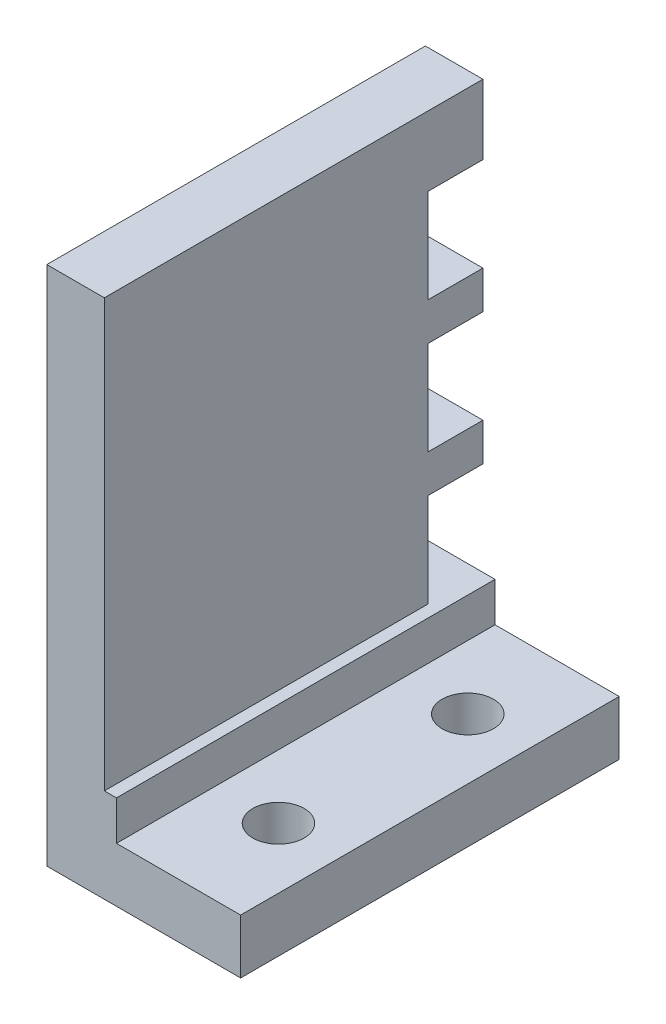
ISO-10303-21;
HEADER;
FILE_DESCRIPTION(('STEP AP214'),'2;1');
FILE_NAME('part.step','',(''),(''),'','','');
FILE_SCHEMA(('AUTOMOTIVE_DESIGN { 1 0 10303 214 1 1 1 1 }'));
ENDSEC;
DATA;
#1=APPLICATION_CONTEXT('core data for automotive mechanical design processes');
#2=APPLICATION_PROTOCOL_DEFINITION('international standard','automotive_design',2000,#1);
#3=PRODUCT_CONTEXT('',#1,'mechanical');
#4=PRODUCT('Part','Part','',(#3));
#5=PRODUCT_RELATED_PRODUCT_CATEGORY('part','',(#4));
#6=PRODUCT_DEFINITION_FORMATION('','',#4);
#7=PRODUCT_DEFINITION_CONTEXT('part definition',#1,'design');
#8=PRODUCT_DEFINITION('design','',#6,#7);
#9=PRODUCT_DEFINITION_SHAPE('','',#8);
#10=(LENGTH_UNIT() NAMED_UNIT(*) SI_UNIT(.MILLI.,.METRE.));
#11=(NAMED_UNIT(*) PLANE_ANGLE_UNIT() SI_UNIT($,.RADIAN.));
#12=(NAMED_UNIT(*) SI_UNIT($,.STERADIAN.) SOLID_ANGLE_UNIT());
#13=UNCERTAINTY_MEASURE_WITH_UNIT(LENGTH_MEASURE(1.E-05),#10,'distance_accuracy_value','');
#14=(GEOMETRIC_REPRESENTATION_CONTEXT(3) GLOBAL_UNCERTAINTY_ASSIGNED_CONTEXT((#13)) GLOBAL_UNIT_ASSIGNED_CONTEXT((#10,
#11,#12)) REPRESENTATION_CONTEXT('',''));
#15=CARTESIAN_POINT('',(0.,0.,0.));
#16=DIRECTION('',(0.,0.,1.));
#17=DIRECTION('',(1.,0.,0.));
#18=AXIS2_PLACEMENT_3D('',#15,#16,#17);
#19=CARTESIAN_POINT('',(0.,0.,0.));
#20=DIRECTION('',(0.,0.,1.));
#21=DIRECTION('',(1.,0.,0.));
#22=AXIS2_PLACEMENT_3D('',#19,#20,#21);
#23=PLANE('',#22);
#24=DIRECTION('',(0.,1.,0.));
#25=VECTOR('',#24,1.);
#26=CARTESIAN_POINT('',(4.826,7.874,0.));
#27=LINE('',#26,#25);
#28=CARTESIAN_POINT('',(4.826,15.748,0.));
#29=VERTEX_POINT('',#28);
#30=CARTESIAN_POINT('',(4.826,18.923,0.));
#31=VERTEX_POINT('',#30);
#32=EDGE_CURVE('E53',#29,#31,#27,.T.);
#33=ORIENTED_EDGE('',*,*,#32,.F.);
#34=DIRECTION('',(1.,0.,0.));
#35=VECTOR('',#34,1.);
#36=CARTESIAN_POINT('',(-0.00100000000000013,15.748,0.));
#37=LINE('',#36,#35);
#38=CARTESIAN_POINT('',(0.,15.748,0.));
#39=VERTEX_POINT('',#38);
#40=EDGE_CURVE('E183',#39,#29,#37,.T.);
#41=ORIENTED_EDGE('',*,*,#40,.F.);
#42=DIRECTION('',(0.,-1.,0.));
#43=VECTOR('',#42,1.);
#44=CARTESIAN_POINT('',(0.,43.688,0.));
#45=LINE('',#44,#43);
#46=CARTESIAN_POINT('',(0.,18.923,0.));
#47=VERTEX_POINT('',#46);
#48=EDGE_CURVE('E368',#47,#39,#45,.T.);
#49=ORIENTED_EDGE('',*,*,#48,.F.);
#50=DIRECTION('',(1.,0.,0.));
#51=VECTOR('',#50,1.);
#52=CARTESIAN_POINT('',(-0.00100000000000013,18.923,0.));
#53=LINE('',#52,#51);
#54=EDGE_CURVE('E226',#47,#31,#53,.T.);
#55=ORIENTED_EDGE('',*,*,#54,.T.);
#56=EDGE_LOOP('',(#33,#41,#49,#55));
#57=FACE_BOUND('',#56,.T.);
#58=ADVANCED_FACE('F37',(#57),#23,.F.);
#59=CARTESIAN_POINT('',(4.826,26.797,0.));
#60=VERTEX_POINT('',#59);
#61=CARTESIAN_POINT('',(4.826,29.972,0.));
#62=VERTEX_POINT('',#61);
#63=EDGE_CURVE('E60',#60,#62,#27,.T.);
#64=ORIENTED_EDGE('',*,*,#63,.F.);
#65=DIRECTION('',(1.,0.,0.));
#66=VECTOR('',#65,1.);
#67=CARTESIAN_POINT('',(-0.00100000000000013,26.797,0.));
#68=LINE('',#67,#66);
#69=CARTESIAN_POINT('',(0.,26.797,0.));
#70=VERTEX_POINT('',#69);
#71=EDGE_CURVE('E224',#70,#60,#68,.T.);
#72=ORIENTED_EDGE('',*,*,#71,.F.);
#73=CARTESIAN_POINT('',(0.,29.972,0.));
#74=VERTEX_POINT('',#73);
#75=EDGE_CURVE('E292',#74,#70,#45,.T.);
#76=ORIENTED_EDGE('',*,*,#75,.F.);
#77=DIRECTION('',(1.,0.,0.));
#78=VECTOR('',#77,1.);
#79=CARTESIAN_POINT('',(-0.00100000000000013,29.972,0.));
#80=LINE('',#79,#78);
#81=EDGE_CURVE('E251',#74,#62,#80,.T.);
#82=ORIENTED_EDGE('',*,*,#81,.T.);
#83=EDGE_LOOP('',(#64,#72,#76,#82));
#84=FACE_BOUND('',#83,.T.);
#85=ADVANCED_FACE('F367',(#84),#23,.F.);
#86=CARTESIAN_POINT('',(4.826,37.846,0.));
#87=VERTEX_POINT('',#86);
#88=CARTESIAN_POINT('',(4.826,43.688,0.));
#89=VERTEX_POINT('',#88);
#90=EDGE_CURVE('E301',#87,#89,#27,.T.);
#91=ORIENTED_EDGE('',*,*,#90,.F.);
#92=DIRECTION('',(1.,0.,0.));
#93=VECTOR('',#92,1.);
#94=CARTESIAN_POINT('',(-0.00100000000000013,37.846,0.));
#95=LINE('',#94,#93);
#96=CARTESIAN_POINT('',(0.,37.846,0.));
#97=VERTEX_POINT('',#96);
#98=EDGE_CURVE('E249',#97,#87,#95,.T.);
#99=ORIENTED_EDGE('',*,*,#98,.F.);
#100=CARTESIAN_POINT('',(0.,43.688,0.));
#101=VERTEX_POINT('',#100);
#102=EDGE_CURVE('E288',#101,#97,#45,.T.);
#103=ORIENTED_EDGE('',*,*,#102,.F.);
#104=DIRECTION('',(-1.,0.,0.));
#105=VECTOR('',#104,1.);
#106=CARTESIAN_POINT('',(4.826,43.688,0.));
#107=LINE('',#106,#105);
#108=EDGE_CURVE('E266',#89,#101,#107,.T.);
#109=ORIENTED_EDGE('',*,*,#108,.F.);
#110=EDGE_LOOP('',(#91,#99,#103,#109));
#111=FACE_BOUND('',#110,.T.);
#112=ADVANCED_FACE('F350',(#111),#23,.F.);
#113=CARTESIAN_POINT('',(4.826,43.688,31.75));
#114=DIRECTION('',(0.,-1.,0.));
#115=DIRECTION('',(0.,0.,-1.));
#116=AXIS2_PLACEMENT_3D('',#113,#114,#115);
#117=PLANE('',#116);
#118=ORIENTED_EDGE('',*,*,#108,.T.);
#119=DIRECTION('',(0.,0.,-1.));
#120=VECTOR('',#119,1.);
#121=CARTESIAN_POINT('',(0.,43.688,31.75));
#122=LINE('',#121,#120);
#123=CARTESIAN_POINT('',(0.,43.688,31.75));
#124=VERTEX_POINT('',#123);
#125=EDGE_CURVE('E11',#124,#101,#122,.T.);
#126=ORIENTED_EDGE('',*,*,#125,.F.);
#127=DIRECTION('',(-1.,0.,0.));
#128=VECTOR('',#127,1.);
#129=CARTESIAN_POINT('',(4.826,43.688,31.75));
#130=LINE('',#129,#128);
#131=CARTESIAN_POINT('',(4.826,43.688,31.75));
#132=VERTEX_POINT('',#131);
#133=EDGE_CURVE('E267',#132,#124,#130,.T.);
#134=ORIENTED_EDGE('',*,*,#133,.F.);
#135=DIRECTION('',(0.,0.,-1.));
#136=VECTOR('',#135,1.);
#137=CARTESIAN_POINT('',(4.826,43.688,31.75));
#138=LINE('',#137,#136);
#139=EDGE_CURVE('E284',#132,#89,#138,.T.);
#140=ORIENTED_EDGE('',*,*,#139,.T.);
#141=EDGE_LOOP('',(#118,#126,#134,#140));
#142=FACE_BOUND('',#141,.T.);
#143=ADVANCED_FACE('F39',(#142),#117,.F.);
#144=CARTESIAN_POINT('',(0.,43.688,31.75));
#145=DIRECTION('',(1.,0.,0.));
#146=DIRECTION('',(0.,1.,0.));
#147=AXIS2_PLACEMENT_3D('',#144,#145,#146);
#148=PLANE('',#147);
#149=ORIENTED_EDGE('',*,*,#48,.T.);
#150=DIRECTION('',(0.,0.,-1.));
#151=VECTOR('',#150,1.);
#152=CARTESIAN_POINT('',(0.,15.748,4.6228));
#153=LINE('',#152,#151);
#154=CARTESIAN_POINT('',(0.,15.748,4.6228));
#155=VERTEX_POINT('',#154);
#156=EDGE_CURVE('E199',#155,#39,#153,.T.);
#157=ORIENTED_EDGE('',*,*,#156,.F.);
#158=DIRECTION('',(0.,1.,0.));
#159=VECTOR('',#158,1.);
#160=CARTESIAN_POINT('',(0.,15.748,4.6228));
#161=LINE('',#160,#159);
#162=CARTESIAN_POINT('',(0.,7.874,4.6228));
#163=VERTEX_POINT('',#162);
#164=EDGE_CURVE('E176',#163,#155,#161,.T.);
#165=ORIENTED_EDGE('',*,*,#164,.F.);
#166=DIRECTION('',(0.,0.,1.));
#167=VECTOR('',#166,1.);
#168=CARTESIAN_POINT('',(0.,7.874,4.6228));
#169=LINE('',#168,#167);
#170=CARTESIAN_POINT('',(0.,7.874,0.));
#171=VERTEX_POINT('',#170);
#172=EDGE_CURVE('E187',#171,#163,#169,.T.);
#173=ORIENTED_EDGE('',*,*,#172,.F.);
#174=CARTESIAN_POINT('',(0.,0.,0.));
#175=VERTEX_POINT('',#174);
#176=EDGE_CURVE('E287',#171,#175,#45,.T.);
#177=ORIENTED_EDGE('',*,*,#176,.T.);
#178=DIRECTION('',(0.,0.,-1.));
#179=VECTOR('',#178,1.);
#180=CARTESIAN_POINT('',(0.,0.,31.75));
#181=LINE('',#180,#179);
#182=CARTESIAN_POINT('',(0.,0.,31.75));
#183=VERTEX_POINT('',#182);
#184=EDGE_CURVE('E46',#183,#175,#181,.T.);
#185=ORIENTED_EDGE('',*,*,#184,.F.);
#186=DIRECTION('',(0.,-1.,0.));
#187=VECTOR('',#186,1.);
#188=CARTESIAN_POINT('',(0.,43.688,31.75));
#189=LINE('',#188,#187);
#190=EDGE_CURVE('E270',#124,#183,#189,.T.);
#191=ORIENTED_EDGE('',*,*,#190,.F.);
#192=ORIENTED_EDGE('',*,*,#125,.T.);
#193=ORIENTED_EDGE('',*,*,#102,.T.);
#194=DIRECTION('',(0.,0.,-1.));
#195=VECTOR('',#194,1.);
#196=CARTESIAN_POINT('',(0.,37.846,4.6228));
#197=LINE('',#196,#195);
#198=CARTESIAN_POINT('',(0.,37.846,4.6228));
#199=VERTEX_POINT('',#198);
#200=EDGE_CURVE('E235',#199,#97,#197,.T.);
#201=ORIENTED_EDGE('',*,*,#200,.F.);
#202=DIRECTION('',(0.,1.,0.));
#203=VECTOR('',#202,1.);
#204=CARTESIAN_POINT('',(0.,37.846,4.6228));
#205=LINE('',#204,#203);
#206=CARTESIAN_POINT('',(0.,29.972,4.6228));
#207=VERTEX_POINT('',#206);
#208=EDGE_CURVE('E232',#207,#199,#205,.T.);
#209=ORIENTED_EDGE('',*,*,#208,.F.);
#210=DIRECTION('',(0.,0.,1.));
#211=VECTOR('',#210,1.);
#212=CARTESIAN_POINT('',(0.,29.972,4.6228));
#213=LINE('',#212,#211);
#214=EDGE_CURVE('E248',#74,#207,#213,.T.);
#215=ORIENTED_EDGE('',*,*,#214,.F.);
#216=ORIENTED_EDGE('',*,*,#75,.T.);
#217=DIRECTION('',(0.,0.,-1.));
#218=VECTOR('',#217,1.);
#219=CARTESIAN_POINT('',(0.,26.797,4.6228));
#220=LINE('',#219,#218);
#221=CARTESIAN_POINT('',(0.,26.797,4.6228));
#222=VERTEX_POINT('',#221);
#223=EDGE_CURVE('E210',#222,#70,#220,.T.);
#224=ORIENTED_EDGE('',*,*,#223,.F.);
#225=DIRECTION('',(0.,1.,0.));
#226=VECTOR('',#225,1.);
#227=CARTESIAN_POINT('',(0.,26.797,4.6228));
#228=LINE('',#227,#226);
#229=CARTESIAN_POINT('',(0.,18.923,4.6228));
#230=VERTEX_POINT('',#229);
#231=EDGE_CURVE('E194',#230,#222,#228,.T.);
#232=ORIENTED_EDGE('',*,*,#231,.F.);
#233=DIRECTION('',(0.,0.,1.));
#234=VECTOR('',#233,1.);
#235=CARTESIAN_POINT('',(0.,18.923,4.6228));
#236=LINE('',#235,#234);
#237=EDGE_CURVE('E223',#47,#230,#236,.T.);
#238=ORIENTED_EDGE('',*,*,#237,.F.);
#239=EDGE_LOOP('',(#149,#157,#165,#173,#177,#185,#191,#192,#193,#201,#209,#215,#216,#224,#232,#238));
#240=FACE_BOUND('',#239,.T.);
#241=ADVANCED_FACE('F198',(#240),#148,.F.);
#242=CARTESIAN_POINT('',(0.,0.,31.75));
#243=DIRECTION('',(0.,1.,0.));
#244=DIRECTION('',(0.,0.,1.));
#245=AXIS2_PLACEMENT_3D('',#242,#243,#244);
#246=PLANE('',#245);
#247=CARTESIAN_POINT('',(11.176,0.,23.495));
#248=DIRECTION('',(0.,-1.,0.));
#249=DIRECTION('',(0.,0.,-1.));
#250=AXIS2_PLACEMENT_3D('',#247,#248,#249);
#251=CIRCLE('',#250,2.15265);
#252=CARTESIAN_POINT('',(11.176,0.,21.34235));
#253=VERTEX_POINT('',#252);
#254=EDGE_CURVE('E257',#253,#253,#251,.T.);
#255=ORIENTED_EDGE('',*,*,#254,.F.);
#256=EDGE_LOOP('',(#255));
#257=FACE_BOUND('',#256,.T.);
#258=CARTESIAN_POINT('',(11.176,0.,7.62));
#259=DIRECTION('',(0.,-1.,0.));
#260=DIRECTION('',(0.,0.,-1.));
#261=AXIS2_PLACEMENT_3D('',#258,#259,#260);
#262=CIRCLE('',#261,2.15265);
#263=CARTESIAN_POINT('',(11.176,0.,5.46735000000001));
#264=VERTEX_POINT('',#263);
#265=EDGE_CURVE('E260',#264,#264,#262,.T.);
#266=ORIENTED_EDGE('',*,*,#265,.F.);
#267=EDGE_LOOP('',(#266));
#268=FACE_BOUND('',#267,.T.);
#269=DIRECTION('',(1.,0.,0.));
#270=VECTOR('',#269,1.);
#271=CARTESIAN_POINT('',(0.,0.,0.));
#272=LINE('',#271,#270);
#273=CARTESIAN_POINT('',(16.256,0.,0.));
#274=VERTEX_POINT('',#273);
#275=EDGE_CURVE('E291',#175,#274,#272,.T.);
#276=ORIENTED_EDGE('',*,*,#275,.T.);
#277=DIRECTION('',(0.,0.,-1.));
#278=VECTOR('',#277,1.);
#279=CARTESIAN_POINT('',(16.256,0.,31.75));
#280=LINE('',#279,#278);
#281=CARTESIAN_POINT('',(16.256,0.,31.75));
#282=VERTEX_POINT('',#281);
#283=EDGE_CURVE('E315',#282,#274,#280,.T.);
#284=ORIENTED_EDGE('',*,*,#283,.F.);
#285=DIRECTION('',(1.,0.,0.));
#286=VECTOR('',#285,1.);
#287=CARTESIAN_POINT('',(0.,0.,31.75));
#288=LINE('',#287,#286);
#289=EDGE_CURVE('E272',#183,#282,#288,.T.);
#290=ORIENTED_EDGE('',*,*,#289,.F.);
#291=ORIENTED_EDGE('',*,*,#184,.T.);
#292=EDGE_LOOP('',(#276,#284,#290,#291));
#293=FACE_BOUND('',#292,.T.);
#294=ADVANCED_FACE('F323',(#257,#268,#293),#246,.F.);
#295=CARTESIAN_POINT('',(16.256,0.,31.75));
#296=DIRECTION('',(-1.,0.,0.));
#297=DIRECTION('',(0.,0.,1.));
#298=AXIS2_PLACEMENT_3D('',#295,#296,#297);
#299=PLANE('',#298);
#300=DIRECTION('',(0.,1.,0.));
#301=VECTOR('',#300,1.);
#302=CARTESIAN_POINT('',(16.256,0.,0.));
#303=LINE('',#302,#301);
#304=CARTESIAN_POINT('',(16.256,4.572,0.));
#305=VERTEX_POINT('',#304);
#306=EDGE_CURVE('E294',#274,#305,#303,.T.);
#307=ORIENTED_EDGE('',*,*,#306,.T.);
#308=DIRECTION('',(0.,0.,-1.));
#309=VECTOR('',#308,1.);
#310=CARTESIAN_POINT('',(16.256,4.572,31.75));
#311=LINE('',#310,#309);
#312=CARTESIAN_POINT('',(16.256,4.572,31.75));
#313=VERTEX_POINT('',#312);
#314=EDGE_CURVE('E312',#313,#305,#311,.T.);
#315=ORIENTED_EDGE('',*,*,#314,.F.);
#316=DIRECTION('',(0.,1.,0.));
#317=VECTOR('',#316,1.);
#318=CARTESIAN_POINT('',(16.256,0.,31.75));
#319=LINE('',#318,#317);
#320=EDGE_CURVE('E274',#282,#313,#319,.T.);
#321=ORIENTED_EDGE('',*,*,#320,.F.);
#322=ORIENTED_EDGE('',*,*,#283,.T.);
#323=EDGE_LOOP('',(#307,#315,#321,#322));
#324=FACE_BOUND('',#323,.T.);
#325=ADVANCED_FACE('F332',(#324),#299,.F.);
#326=CARTESIAN_POINT('',(16.256,4.572,31.75));
#327=DIRECTION('',(0.,-1.,0.));
#328=DIRECTION('',(1.,0.,0.));
#329=AXIS2_PLACEMENT_3D('',#326,#327,#328);
#330=PLANE('',#329);
#331=CARTESIAN_POINT('',(11.176,4.572,23.495));
#332=DIRECTION('',(0.,-1.,0.));
#333=DIRECTION('',(1.,0.,0.));
#334=AXIS2_PLACEMENT_3D('',#331,#332,#333);
#335=CIRCLE('',#334,2.15264999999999);
#336=CARTESIAN_POINT('',(13.32865,4.572,23.495));
#337=VERTEX_POINT('',#336);
#338=EDGE_CURVE('E41',#337,#337,#335,.T.);
#339=ORIENTED_EDGE('',*,*,#338,.T.);
#340=EDGE_LOOP('',(#339));
#341=FACE_BOUND('',#340,.T.);
#342=CARTESIAN_POINT('',(11.176,4.572,7.62));
#343=DIRECTION('',(0.,-1.,0.));
#344=DIRECTION('',(1.,0.,0.));
#345=AXIS2_PLACEMENT_3D('',#342,#343,#344);
#346=CIRCLE('',#345,2.15264999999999);
#347=CARTESIAN_POINT('',(13.32865,4.572,7.62));
#348=VERTEX_POINT('',#347);
#349=EDGE_CURVE('E263',#348,#348,#346,.T.);
#350=ORIENTED_EDGE('',*,*,#349,.T.);
#351=EDGE_LOOP('',(#350));
#352=FACE_BOUND('',#351,.T.);
#353=DIRECTION('',(-1.,0.,0.));
#354=VECTOR('',#353,1.);
#355=CARTESIAN_POINT('',(16.256,4.572,0.));
#356=LINE('',#355,#354);
#357=CARTESIAN_POINT('',(5.842,4.572,0.));
#358=VERTEX_POINT('',#357);
#359=EDGE_CURVE('E296',#305,#358,#356,.T.);
#360=ORIENTED_EDGE('',*,*,#359,.T.);
#361=DIRECTION('',(0.,0.,-1.));
#362=VECTOR('',#361,1.);
#363=CARTESIAN_POINT('',(5.842,4.572,31.75));
#364=LINE('',#363,#362);
#365=CARTESIAN_POINT('',(5.842,4.572,31.75));
#366=VERTEX_POINT('',#365);
#367=EDGE_CURVE('E309',#366,#358,#364,.T.);
#368=ORIENTED_EDGE('',*,*,#367,.F.);
#369=DIRECTION('',(-1.,0.,0.));
#370=VECTOR('',#369,1.);
#371=CARTESIAN_POINT('',(16.256,4.572,31.75));
#372=LINE('',#371,#370);
#373=EDGE_CURVE('E276',#313,#366,#372,.T.);
#374=ORIENTED_EDGE('',*,*,#373,.F.);
#375=ORIENTED_EDGE('',*,*,#314,.T.);
#376=EDGE_LOOP('',(#360,#368,#374,#375));
#377=FACE_BOUND('',#376,.T.);
#378=ADVANCED_FACE('F336',(#341,#352,#377),#330,.F.);
#379=CARTESIAN_POINT('',(5.842,4.572,31.75));
#380=DIRECTION('',(-1.,0.,0.));
#381=DIRECTION('',(0.,0.,1.));
#382=AXIS2_PLACEMENT_3D('',#379,#380,#381);
#383=PLANE('',#382);
#384=DIRECTION('',(0.,1.,0.));
#385=VECTOR('',#384,1.);
#386=CARTESIAN_POINT('',(5.842,4.572,0.));
#387=LINE('',#386,#385);
#388=CARTESIAN_POINT('',(5.842,7.874,0.));
#389=VERTEX_POINT('',#388);
#390=EDGE_CURVE('E298',#358,#389,#387,.T.);
#391=ORIENTED_EDGE('',*,*,#390,.T.);
#392=DIRECTION('',(0.,0.,-1.));
#393=VECTOR('',#392,1.);
#394=CARTESIAN_POINT('',(5.842,7.874,31.75));
#395=LINE('',#394,#393);
#396=CARTESIAN_POINT('',(5.842,7.874,31.75));
#397=VERTEX_POINT('',#396);
#398=EDGE_CURVE('E307',#397,#389,#395,.T.);
#399=ORIENTED_EDGE('',*,*,#398,.F.);
#400=DIRECTION('',(0.,1.,0.));
#401=VECTOR('',#400,1.);
#402=CARTESIAN_POINT('',(5.842,4.572,31.75));
#403=LINE('',#402,#401);
#404=EDGE_CURVE('E278',#366,#397,#403,.T.);
#405=ORIENTED_EDGE('',*,*,#404,.F.);
#406=ORIENTED_EDGE('',*,*,#367,.T.);
#407=EDGE_LOOP('',(#391,#399,#405,#406));
#408=FACE_BOUND('',#407,.T.);
#409=ADVANCED_FACE('F379',(#408),#383,.F.);
#410=CARTESIAN_POINT('',(5.842,7.874,31.75));
#411=DIRECTION('',(0.,-1.,0.));
#412=DIRECTION('',(0.,0.,-1.));
#413=AXIS2_PLACEMENT_3D('',#410,#411,#412);
#414=PLANE('',#413);
#415=DIRECTION('',(-1.,0.,0.));
#416=VECTOR('',#415,1.);
#417=CARTESIAN_POINT('',(5.842,7.874,0.));
#418=LINE('',#417,#416);
#419=EDGE_CURVE('E191',#389,#171,#418,.T.);
#420=ORIENTED_EDGE('',*,*,#419,.T.);
#421=ORIENTED_EDGE('',*,*,#172,.T.);
#422=DIRECTION('',(1.,0.,0.));
#423=VECTOR('',#422,1.);
#424=CARTESIAN_POINT('',(-0.00100000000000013,7.874,4.6228));
#425=LINE('',#424,#423);
#426=CARTESIAN_POINT('',(4.826,7.874,4.6228));
#427=VERTEX_POINT('',#426);
#428=EDGE_CURVE('E172',#163,#427,#425,.T.);
#429=ORIENTED_EDGE('',*,*,#428,.T.);
#430=DIRECTION('',(0.,0.,-1.));
#431=VECTOR('',#430,1.);
#432=CARTESIAN_POINT('',(4.826,7.874,31.75));
#433=LINE('',#432,#431);
#434=CARTESIAN_POINT('',(4.826,7.874,31.75));
#435=VERTEX_POINT('',#434);
#436=EDGE_CURVE('E305',#435,#427,#433,.T.);
#437=ORIENTED_EDGE('',*,*,#436,.F.);
#438=DIRECTION('',(-1.,0.,0.));
#439=VECTOR('',#438,1.);
#440=CARTESIAN_POINT('',(5.842,7.874,31.75));
#441=LINE('',#440,#439);
#442=EDGE_CURVE('E280',#397,#435,#441,.T.);
#443=ORIENTED_EDGE('',*,*,#442,.F.);
#444=ORIENTED_EDGE('',*,*,#398,.T.);
#445=EDGE_LOOP('',(#420,#421,#429,#437,#443,#444));
#446=FACE_BOUND('',#445,.T.);
#447=ADVANCED_FACE('F188',(#446),#414,.F.);
#448=CARTESIAN_POINT('',(4.826,7.874,31.75));
#449=DIRECTION('',(-1.,0.,0.));
#450=DIRECTION('',(0.,0.,1.));
#451=AXIS2_PLACEMENT_3D('',#448,#449,#450);
#452=PLANE('',#451);
#453=ORIENTED_EDGE('',*,*,#436,.T.);
#454=DIRECTION('',(0.,-1.,0.));
#455=VECTOR('',#454,1.);
#456=CARTESIAN_POINT('',(4.826,15.748,4.6228));
#457=LINE('',#456,#455);
#458=CARTESIAN_POINT('',(4.826,15.748,4.6228));
#459=VERTEX_POINT('',#458);
#460=EDGE_CURVE('E179',#459,#427,#457,.T.);
#461=ORIENTED_EDGE('',*,*,#460,.F.);
#462=DIRECTION('',(0.,0.,1.));
#463=VECTOR('',#462,1.);
#464=CARTESIAN_POINT('',(4.826,15.748,4.6228));
#465=LINE('',#464,#463);
#466=EDGE_CURVE('E184',#29,#459,#465,.T.);
#467=ORIENTED_EDGE('',*,*,#466,.F.);
#468=ORIENTED_EDGE('',*,*,#32,.T.);
#469=DIRECTION('',(0.,0.,-1.));
#470=VECTOR('',#469,1.);
#471=CARTESIAN_POINT('',(4.826,18.923,4.6228));
#472=LINE('',#471,#470);
#473=CARTESIAN_POINT('',(4.826,18.923,4.6228));
#474=VERTEX_POINT('',#473);
#475=EDGE_CURVE('E215',#474,#31,#472,.T.);
#476=ORIENTED_EDGE('',*,*,#475,.F.);
#477=DIRECTION('',(0.,-1.,0.));
#478=VECTOR('',#477,1.);
#479=CARTESIAN_POINT('',(4.826,26.797,4.6228));
#480=LINE('',#479,#478);
#481=CARTESIAN_POINT('',(4.826,26.797,4.6228));
#482=VERTEX_POINT('',#481);
#483=EDGE_CURVE('E212',#482,#474,#480,.T.);
#484=ORIENTED_EDGE('',*,*,#483,.F.);
#485=DIRECTION('',(0.,0.,1.));
#486=VECTOR('',#485,1.);
#487=CARTESIAN_POINT('',(4.826,26.797,4.6228));
#488=LINE('',#487,#486);
#489=EDGE_CURVE('E217',#60,#482,#488,.T.);
#490=ORIENTED_EDGE('',*,*,#489,.F.);
#491=ORIENTED_EDGE('',*,*,#63,.T.);
#492=DIRECTION('',(0.,0.,-1.));
#493=VECTOR('',#492,1.);
#494=CARTESIAN_POINT('',(4.826,29.972,4.6228));
#495=LINE('',#494,#493);
#496=CARTESIAN_POINT('',(4.826,29.972,4.6228));
#497=VERTEX_POINT('',#496);
#498=EDGE_CURVE('E240',#497,#62,#495,.T.);
#499=ORIENTED_EDGE('',*,*,#498,.F.);
#500=DIRECTION('',(0.,-1.,0.));
#501=VECTOR('',#500,1.);
#502=CARTESIAN_POINT('',(4.826,37.846,4.6228));
#503=LINE('',#502,#501);
#504=CARTESIAN_POINT('',(4.826,37.846,4.6228));
#505=VERTEX_POINT('',#504);
#506=EDGE_CURVE('E237',#505,#497,#503,.T.);
#507=ORIENTED_EDGE('',*,*,#506,.F.);
#508=DIRECTION('',(0.,0.,1.));
#509=VECTOR('',#508,1.);
#510=CARTESIAN_POINT('',(4.826,37.846,4.6228));
#511=LINE('',#510,#509);
#512=EDGE_CURVE('E242',#87,#505,#511,.T.);
#513=ORIENTED_EDGE('',*,*,#512,.F.);
#514=ORIENTED_EDGE('',*,*,#90,.T.);
#515=ORIENTED_EDGE('',*,*,#139,.F.);
#516=DIRECTION('',(0.,1.,0.));
#517=VECTOR('',#516,1.);
#518=CARTESIAN_POINT('',(4.826,7.874,31.75));
#519=LINE('',#518,#517);
#520=EDGE_CURVE('E282',#435,#132,#519,.T.);
#521=ORIENTED_EDGE('',*,*,#520,.F.);
#522=EDGE_LOOP('',(#453,#461,#467,#468,#476,#484,#490,#491,#499,#507,#513,#514,#515,#521));
#523=FACE_BOUND('',#522,.T.);
#524=ADVANCED_FACE('F356',(#523),#452,.F.);
#525=CARTESIAN_POINT('',(0.,0.,31.75));
#526=DIRECTION('',(0.,0.,1.));
#527=DIRECTION('',(1.,0.,0.));
#528=AXIS2_PLACEMENT_3D('',#525,#526,#527);
#529=PLANE('',#528);
#530=ORIENTED_EDGE('',*,*,#133,.T.);
#531=ORIENTED_EDGE('',*,*,#190,.T.);
#532=ORIENTED_EDGE('',*,*,#289,.T.);
#533=ORIENTED_EDGE('',*,*,#320,.T.);
#534=ORIENTED_EDGE('',*,*,#373,.T.);
#535=ORIENTED_EDGE('',*,*,#404,.T.);
#536=ORIENTED_EDGE('',*,*,#442,.T.);
#537=ORIENTED_EDGE('',*,*,#520,.T.);
#538=EDGE_LOOP('',(#530,#531,#532,#533,#534,#535,#536,#537));
#539=FACE_BOUND('',#538,.T.);
#540=ADVANCED_FACE('F340',(#539),#529,.T.);
#541=ORIENTED_EDGE('',*,*,#176,.F.);
#542=ORIENTED_EDGE('',*,*,#419,.F.);
#543=ORIENTED_EDGE('',*,*,#390,.F.);
#544=ORIENTED_EDGE('',*,*,#359,.F.);
#545=ORIENTED_EDGE('',*,*,#306,.F.);
#546=ORIENTED_EDGE('',*,*,#275,.F.);
#547=EDGE_LOOP('',(#541,#542,#543,#544,#545,#546));
#548=FACE_BOUND('',#547,.T.);
#549=ADVANCED_FACE('F327',(#548),#23,.F.);
#550=CARTESIAN_POINT('',(11.176,0.,7.62));
#551=DIRECTION('',(0.,-1.,0.));
#552=DIRECTION('',(0.,0.,-1.));
#553=AXIS2_PLACEMENT_3D('',#550,#551,#552);
#554=CYLINDRICAL_SURFACE('',#553,2.15264999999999);
#555=ORIENTED_EDGE('',*,*,#265,.T.);
#556=EDGE_LOOP('',(#555));
#557=FACE_BOUND('',#556,.T.);
#558=ORIENTED_EDGE('',*,*,#349,.F.);
#559=EDGE_LOOP('',(#558));
#560=FACE_BOUND('',#559,.T.);
#561=ADVANCED_FACE('F397',(#557,#560),#554,.F.);
#562=CARTESIAN_POINT('',(11.176,0.,23.495));
#563=DIRECTION('',(0.,-1.,0.));
#564=DIRECTION('',(0.,0.,-1.));
#565=AXIS2_PLACEMENT_3D('',#562,#563,#564);
#566=CYLINDRICAL_SURFACE('',#565,2.15264999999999);
#567=ORIENTED_EDGE('',*,*,#254,.T.);
#568=EDGE_LOOP('',(#567));
#569=FACE_BOUND('',#568,.T.);
#570=ORIENTED_EDGE('',*,*,#338,.F.);
#571=EDGE_LOOP('',(#570));
#572=FACE_BOUND('',#571,.T.);
#573=ADVANCED_FACE('F402',(#569,#572),#566,.F.);
#574=CARTESIAN_POINT('',(-0.00100000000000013,37.846,4.6228));
#575=DIRECTION('',(0.,0.,1.));
#576=DIRECTION('',(0.,-1.,0.));
#577=AXIS2_PLACEMENT_3D('',#574,#575,#576);
#578=PLANE('',#577);
#579=ORIENTED_EDGE('',*,*,#208,.T.);
#580=DIRECTION('',(1.,0.,0.));
#581=VECTOR('',#580,1.);
#582=CARTESIAN_POINT('',(-0.00100000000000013,37.846,4.6228));
#583=LINE('',#582,#581);
#584=EDGE_CURVE('E246',#199,#505,#583,.T.);
#585=ORIENTED_EDGE('',*,*,#584,.T.);
#586=ORIENTED_EDGE('',*,*,#506,.T.);
#587=DIRECTION('',(1.,0.,0.));
#588=VECTOR('',#587,1.);
#589=CARTESIAN_POINT('',(-0.00100000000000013,29.972,4.6228));
#590=LINE('',#589,#588);
#591=EDGE_CURVE('E245',#207,#497,#590,.T.);
#592=ORIENTED_EDGE('',*,*,#591,.F.);
#593=EDGE_LOOP('',(#579,#585,#586,#592));
#594=FACE_BOUND('',#593,.T.);
#595=ADVANCED_FACE('F358',(#594),#578,.F.);
#596=CARTESIAN_POINT('',(-0.00100000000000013,37.846,4.6228));
#597=DIRECTION('',(0.,1.,0.));
#598=DIRECTION('',(0.,0.,1.));
#599=AXIS2_PLACEMENT_3D('',#596,#597,#598);
#600=PLANE('',#599);
#601=ORIENTED_EDGE('',*,*,#200,.T.);
#602=ORIENTED_EDGE('',*,*,#98,.T.);
#603=ORIENTED_EDGE('',*,*,#512,.T.);
#604=ORIENTED_EDGE('',*,*,#584,.F.);
#605=EDGE_LOOP('',(#601,#602,#603,#604));
#606=FACE_BOUND('',#605,.T.);
#607=ADVANCED_FACE('F354',(#606),#600,.F.);
#608=CARTESIAN_POINT('',(-0.00100000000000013,29.972,4.6228));
#609=DIRECTION('',(0.,-1.,0.));
#610=DIRECTION('',(0.,0.,-1.));
#611=AXIS2_PLACEMENT_3D('',#608,#609,#610);
#612=PLANE('',#611);
#613=ORIENTED_EDGE('',*,*,#214,.T.);
#614=ORIENTED_EDGE('',*,*,#591,.T.);
#615=ORIENTED_EDGE('',*,*,#498,.T.);
#616=ORIENTED_EDGE('',*,*,#81,.F.);
#617=EDGE_LOOP('',(#613,#614,#615,#616));
#618=FACE_BOUND('',#617,.T.);
#619=ADVANCED_FACE('F503',(#618),#612,.F.);
#620=CARTESIAN_POINT('',(-0.00100000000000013,26.797,4.6228));
#621=DIRECTION('',(0.,0.,1.));
#622=DIRECTION('',(1.,0.,0.));
#623=AXIS2_PLACEMENT_3D('',#620,#621,#622);
#624=PLANE('',#623);
#625=ORIENTED_EDGE('',*,*,#231,.T.);
#626=DIRECTION('',(1.,0.,0.));
#627=VECTOR('',#626,1.);
#628=CARTESIAN_POINT('',(-0.00100000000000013,26.797,4.6228));
#629=LINE('',#628,#627);
#630=EDGE_CURVE('E221',#222,#482,#629,.T.);
#631=ORIENTED_EDGE('',*,*,#630,.T.);
#632=ORIENTED_EDGE('',*,*,#483,.T.);
#633=DIRECTION('',(1.,0.,0.));
#634=VECTOR('',#633,1.);
#635=CARTESIAN_POINT('',(-0.00100000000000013,18.923,4.6228));
#636=LINE('',#635,#634);
#637=EDGE_CURVE('E220',#230,#474,#636,.T.);
#638=ORIENTED_EDGE('',*,*,#637,.F.);
#639=EDGE_LOOP('',(#625,#631,#632,#638));
#640=FACE_BOUND('',#639,.T.);
#641=ADVANCED_FACE('F512',(#640),#624,.F.);
#642=CARTESIAN_POINT('',(-0.00100000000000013,26.797,4.6228));
#643=DIRECTION('',(0.,1.,0.));
#644=DIRECTION('',(0.,0.,1.));
#645=AXIS2_PLACEMENT_3D('',#642,#643,#644);
#646=PLANE('',#645);
#647=ORIENTED_EDGE('',*,*,#223,.T.);
#648=ORIENTED_EDGE('',*,*,#71,.T.);
#649=ORIENTED_EDGE('',*,*,#489,.T.);
#650=ORIENTED_EDGE('',*,*,#630,.F.);
#651=EDGE_LOOP('',(#647,#648,#649,#650));
#652=FACE_BOUND('',#651,.T.);
#653=ADVANCED_FACE('F521',(#652),#646,.F.);
#654=CARTESIAN_POINT('',(-0.00100000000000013,18.923,4.6228));
#655=DIRECTION('',(0.,-1.,0.));
#656=DIRECTION('',(0.,0.,-1.));
#657=AXIS2_PLACEMENT_3D('',#654,#655,#656);
#658=PLANE('',#657);
#659=ORIENTED_EDGE('',*,*,#237,.T.);
#660=ORIENTED_EDGE('',*,*,#637,.T.);
#661=ORIENTED_EDGE('',*,*,#475,.T.);
#662=ORIENTED_EDGE('',*,*,#54,.F.);
#663=EDGE_LOOP('',(#659,#660,#661,#662));
#664=FACE_BOUND('',#663,.T.);
#665=ADVANCED_FACE('F531',(#664),#658,.F.);
#666=CARTESIAN_POINT('',(-0.00100000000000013,15.748,4.6228));
#667=DIRECTION('',(0.,0.,1.));
#668=DIRECTION('',(0.,-1.,0.));
#669=AXIS2_PLACEMENT_3D('',#666,#667,#668);
#670=PLANE('',#669);
#671=ORIENTED_EDGE('',*,*,#164,.T.);
#672=DIRECTION('',(1.,0.,0.));
#673=VECTOR('',#672,1.);
#674=CARTESIAN_POINT('',(-0.00100000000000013,15.748,4.6228));
#675=LINE('',#674,#673);
#676=EDGE_CURVE('E195',#155,#459,#675,.T.);
#677=ORIENTED_EDGE('',*,*,#676,.T.);
#678=ORIENTED_EDGE('',*,*,#460,.T.);
#679=ORIENTED_EDGE('',*,*,#428,.F.);
#680=EDGE_LOOP('',(#671,#677,#678,#679));
#681=FACE_BOUND('',#680,.T.);
#682=ADVANCED_FACE('F174',(#681),#670,.F.);
#683=CARTESIAN_POINT('',(-0.00100000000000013,15.748,4.6228));
#684=DIRECTION('',(0.,1.,0.));
#685=DIRECTION('',(0.,0.,1.));
#686=AXIS2_PLACEMENT_3D('',#683,#684,#685);
#687=PLANE('',#686);
#688=ORIENTED_EDGE('',*,*,#156,.T.);
#689=ORIENTED_EDGE('',*,*,#40,.T.);
#690=ORIENTED_EDGE('',*,*,#466,.T.);
#691=ORIENTED_EDGE('',*,*,#676,.F.);
#692=EDGE_LOOP('',(#688,#689,#690,#691));
#693=FACE_BOUND('',#692,.T.);
#694=ADVANCED_FACE('F375',(#693),#687,.F.);
#695=CLOSED_SHELL('',(#58,#85,#112,#143,#241,#294,#325,#378,#409,#447,#524,#540,#549,#561,#573,
#595,#607,#619,#641,#653,#665,#682,#694));
#696=MANIFOLD_SOLID_BREP('B2',#695);
#697=ADVANCED_BREP_SHAPE_REPRESENTATION('',(#18,#696),#14);
#698=SHAPE_DEFINITION_REPRESENTATION(#9,#697);
ENDSEC;
END-ISO-10303-21;
